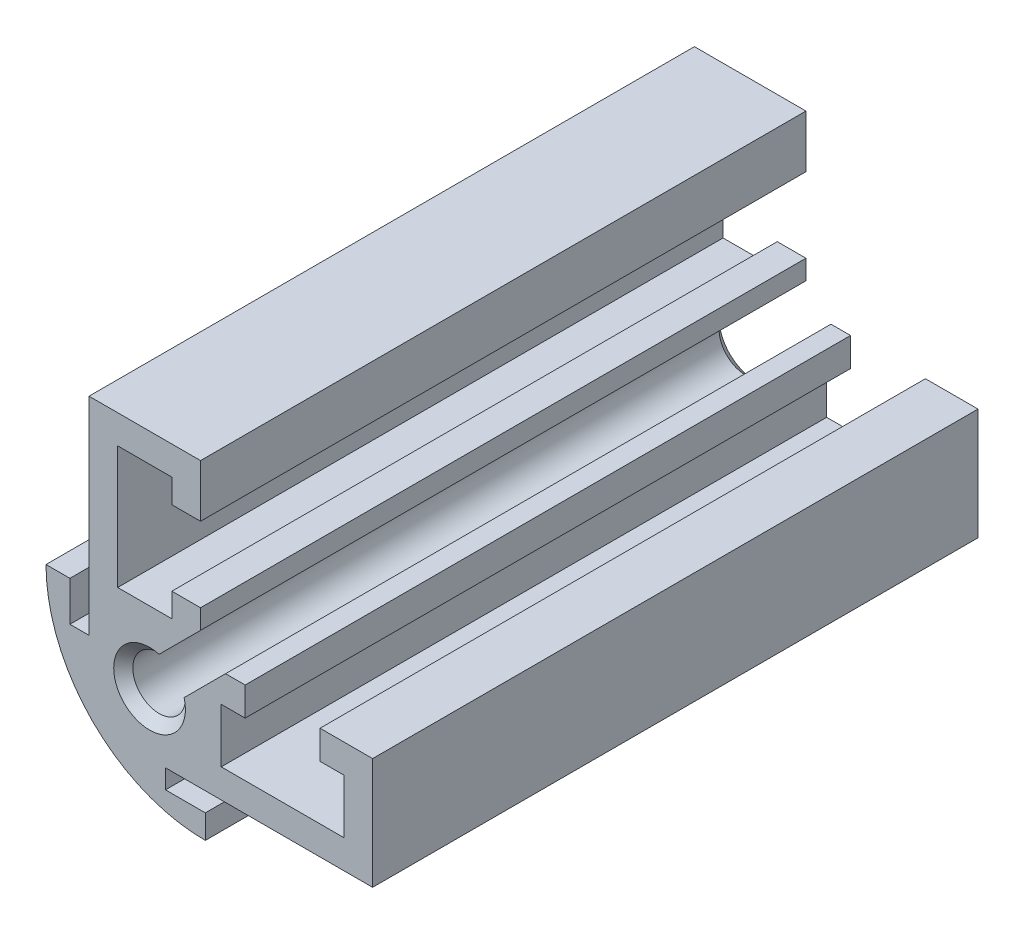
from build123d import *

# Parameters (mm, degrees)
EXTRUDE1_DEPTH     = 19
CUT_EXTRUDE1_DEPTH = 41.670935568
CUT_EXTRUDE2_DEPTH = 41.670935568


with BuildPart() as part:
    # Sketch1 → Extrude1 (new, symmetric)
    with BuildSketch(Plane.XY):
        with BuildLine():
            Line((-10.25, 10.25), (10.25, 10.25))
            Line((10.25, 10.25), (10.25, -10.25))
            Line((10.25, -10.25), (-0.25, -10.25))
            ThreePointArc((-0.25, -10.25), (-7.321067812, -7.321067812), (-10.25, -0.25))
            Line((-10.25, -0.25), (-10.25, 10.25))
        make_face()
    extrude(amount=EXTRUDE1_DEPTH, both=True)

    # Sketch2 → Cut-Extrude1 (cut, through all)
    with BuildSketch(Plane.XY.offset(19)):
        Polygon((10.25, -7.55), (-2.75, -7.55), (-2.75, -8.75), (-0.25, -8.75), (-0.25, -10.25), (10.25, -10.25), align=None)
        Polygon((-7.55, 10.25), (-7.55, -2.75), (-8.75, -2.75), (-8.75, -0.25), (-10.25, -0.25), (-10.25, 10.25), align=None)
    extrude(amount=-CUT_EXTRUDE1_DEPTH, mode=Mode.SUBTRACT)

    # Sketch3 → Cut-Extrude2 (cut, through all)
    with BuildSketch(Plane.XY.offset(19)):
        with BuildLine():
            Line((-0.55, 10.25), (-0.55, 6.95))
            Line((-0.55, 6.95), (-2.35, 6.95))
            Line((-2.35, 6.95), (-2.35, 8.45))
            Line((-2.35, 8.45), (-5.75, 8.45))
            Line((-5.75, 8.45), (-5.75, 0.75))
            Line((-5.75, 0.75), (-2.35, 0.75))
            Line((-2.35, 0.75), (-2.35, 2.25))
            Line((-2.35, 2.25), (-0.55, 2.25))
            Line((-0.55, 2.25), (-0.55, 1.02))
            Line((-0.55, 1.02), (-3.821715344, -2.251715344))
            ThreePointArc((-3.821715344, -2.251715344), (-4.810660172, -4.810660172), (-2.251715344, -3.821715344))
            Line((-2.251715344, -3.821715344), (1.02, -0.55))
            Line((1.02, -0.55), (2.25, -0.55))
            Line((2.25, -0.55), (2.25, -2.35))
            Line((2.25, -2.35), (0.75, -2.35))
            Line((0.75, -2.35), (0.75, -5.75))
            Line((0.75, -5.75), (8.45, -5.75))
            Line((8.45, -5.75), (8.45, -2.35))
            Line((8.45, -2.35), (6.95, -2.35))
            Line((6.95, -2.35), (6.95, -0.55))
            Line((6.95, -0.55), (10.25, -0.55))
            Line((10.25, -0.55), (10.25, 10.25))
            Line((10.25, 10.25), (-0.55, 10.25))
        make_face()
    extrude(amount=-CUT_EXTRUDE2_DEPTH, mode=Mode.SUBTRACT)

    # Esbo_o1 → Furo roscado de M41 (revolve, cut)
    with BuildSketch(Plane(origin=(-3.75, -3.75, 19), x_dir=(0, -1, 0), z_dir=(1, 0, 0))):
        Polygon((0, 0), (0, 38), (2.25, 38), (1.65, 37.4), (1.65, 0.6), (2.25, 0), align=None)
    revolve(axis=Axis((-3.75, -3.75, 25.35), (0, 0, -1)), mode=Mode.SUBTRACT)


solid = part.part
